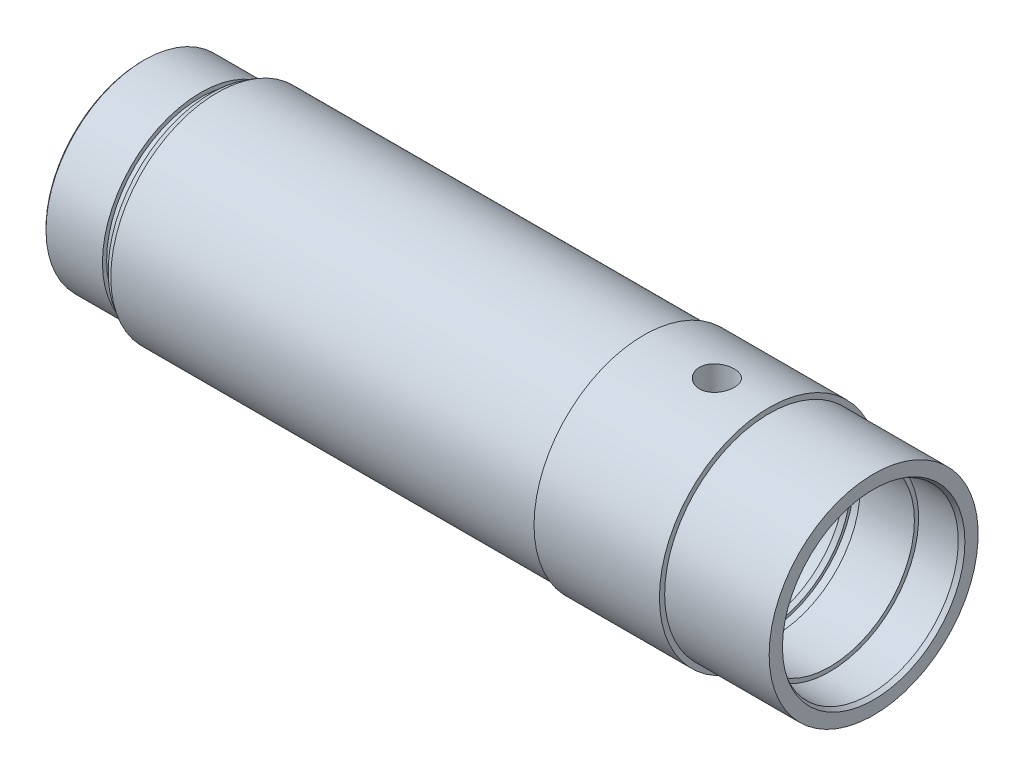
from build123d import *
from OCP.BRepFilletAPI import BRepFilletAPI_MakeChamfer

# Parameters (mm, degrees)
ESQUISSE3_R      = 8.331
EXTRUSION1_DEPTH = 87
CHANFREIN1_SIZE  = 1
CHANFREIN2_SIZE  = 3
CHANFREIN2_SIZE2 = 1.732050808
CHANFREIN3_SIZE  = 2
CHANFREIN3_SIZE2 = 1.154700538


with BuildPart() as part:
    # Esquisse1 → R_volution1 (revolve)
    with BuildSketch(Plane.XY, mode=Mode.PRIVATE) as r_volution1_sk:
        Polygon((0, 40), (298, 40), (298, 42.5), (303, 42.5), (303, 40.5), (329, 40.5), (329, 42.5), (350, 42.5), (350, 50), (300, 50), (300, 52.5), (240, 52.5), (240, 51), (33, 51), (33, 45), (28, 45), (28, 47), (0, 47), align=None)
    revolve(r_volution1_sk.sketch.rotate(Axis((0, 0, 0), (1, 0, 0)), 90), axis=Axis((0, 0, 0), (1, 0, 0)))

    # Esquisse3 → Extrusion1 (cut)
    with BuildSketch(Plane(origin=(0, 0, 0), x_dir=(1, 0, 0), z_dir=(0, 1, 0))):
        with Locations(Location((275, 0, 0), (0, 0, 90))):
            Circle(ESQUISSE3_R)
    extrude(amount=EXTRUSION1_DEPTH, mode=Mode.SUBTRACT)

    # Chanfrein1
    chanfrein1_edges = [part.edges().sort_by_distance(p)[0] for p in [
        (0, 0, -47),
    ]]
    chamfer(chanfrein1_edges, length=CHANFREIN1_SIZE)

    # Chanfrein2
    chanfrein2_edges = [part.edges().sort_by_distance(p)[0] for p in [
        (33, 0, -51),
    ]]
    chanfrein2_side = [part.faces().sort_by_distance(p)[0] for p in [
        (136.5, 0, -51),
    ]]
    chamfer(chanfrein2_edges, length=CHANFREIN2_SIZE, length2=CHANFREIN2_SIZE2, reference=chanfrein2_side[0])

    # Chanfrein3: one chamfer whose edges measure the first distance from different faces: ONE call of the kernel's chamfer builder (chamfer() names one face for all edges)
    chanfrein3_edges_1 = [part.edges().sort_by_distance(p)[0] for p in [
        (350, 0, -42.5),
    ]]
    chanfrein3_side_1 = [part.faces().sort_by_distance(p)[0] for p in [
        (339.5, 0, -42.5),
    ]]
    chanfrein3_edges_2 = [part.edges().sort_by_distance(p)[0] for p in [
        (298, 0, -40),
    ]]
    chanfrein3_side_2 = [part.faces().sort_by_distance(p)[0] for p in [
        (149, 0, -40),
    ]]
    chanfrein3 = BRepFilletAPI_MakeChamfer(part.part.solid().wrapped)
    for e in chanfrein3_edges_1:
        chanfrein3.Add(CHANFREIN3_SIZE, CHANFREIN3_SIZE2, e.wrapped, chanfrein3_side_1[0].wrapped)  # the first distance lies on this face
    for e in chanfrein3_edges_2:
        chanfrein3.Add(CHANFREIN3_SIZE, CHANFREIN3_SIZE2, e.wrapped, chanfrein3_side_2[0].wrapped)  # the first distance lies on this face
    add(Compound.cast(chanfrein3.Shape()), mode=Mode.REPLACE)


solid = part.part
